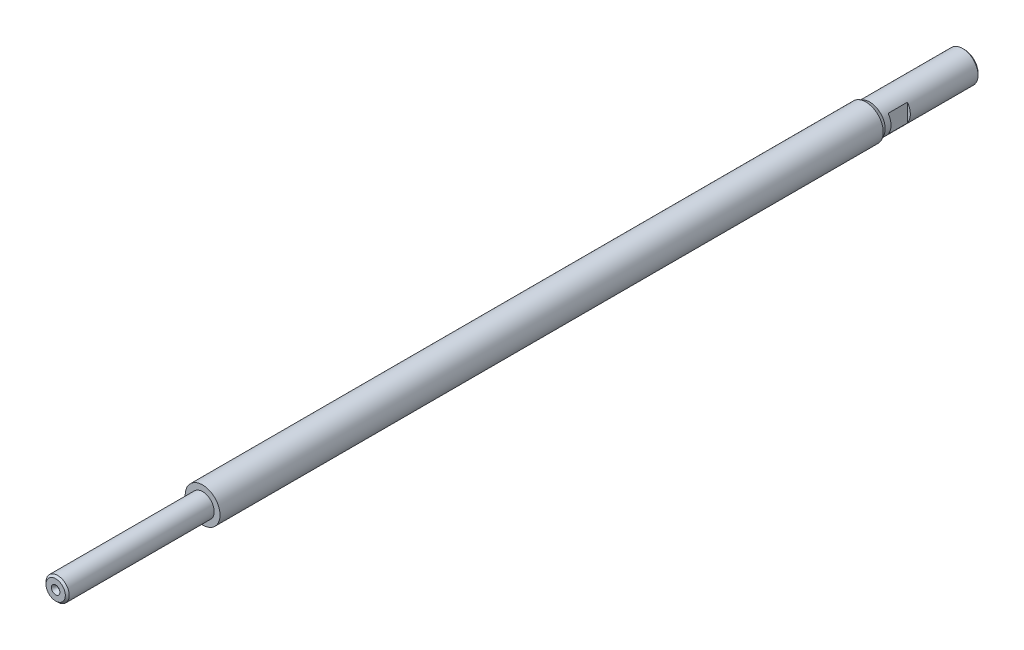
ISO-10303-21;
HEADER;
FILE_DESCRIPTION(('STEP AP214'),'2;1');
FILE_NAME('part.step','',(''),(''),'','','');
FILE_SCHEMA(('AUTOMOTIVE_DESIGN { 1 0 10303 214 1 1 1 1 }'));
ENDSEC;
DATA;
#1=APPLICATION_CONTEXT('core data for automotive mechanical design processes');
#2=APPLICATION_PROTOCOL_DEFINITION('international standard','automotive_design',2000,#1);
#3=PRODUCT_CONTEXT('',#1,'mechanical');
#4=PRODUCT('Part','Part','',(#3));
#5=PRODUCT_RELATED_PRODUCT_CATEGORY('part','',(#4));
#6=PRODUCT_DEFINITION_FORMATION('','',#4);
#7=PRODUCT_DEFINITION_CONTEXT('part definition',#1,'design');
#8=PRODUCT_DEFINITION('design','',#6,#7);
#9=PRODUCT_DEFINITION_SHAPE('','',#8);
#10=(LENGTH_UNIT() NAMED_UNIT(*) SI_UNIT(.MILLI.,.METRE.));
#11=(NAMED_UNIT(*) PLANE_ANGLE_UNIT() SI_UNIT($,.RADIAN.));
#12=(NAMED_UNIT(*) SI_UNIT($,.STERADIAN.) SOLID_ANGLE_UNIT());
#13=UNCERTAINTY_MEASURE_WITH_UNIT(LENGTH_MEASURE(1.E-05),#10,'distance_accuracy_value','');
#14=(GEOMETRIC_REPRESENTATION_CONTEXT(3) GLOBAL_UNCERTAINTY_ASSIGNED_CONTEXT((#13)) GLOBAL_UNIT_ASSIGNED_CONTEXT((#10,
#11,#12)) REPRESENTATION_CONTEXT('',''));
#15=CARTESIAN_POINT('',(0.,0.,0.));
#16=DIRECTION('',(0.,0.,1.));
#17=DIRECTION('',(1.,0.,0.));
#18=AXIS2_PLACEMENT_3D('',#15,#16,#17);
#19=CARTESIAN_POINT('',(0.,0.,-470.));
#20=DIRECTION('',(0.,0.,-1.));
#21=DIRECTION('',(-1.,0.,0.));
#22=AXIS2_PLACEMENT_3D('',#19,#20,#21);
#23=PLANE('',#22);
#24=CARTESIAN_POINT('',(0.,0.,-470.));
#25=DIRECTION('',(0.,0.,-1.));
#26=DIRECTION('',(-1.,0.,0.));
#27=AXIS2_PLACEMENT_3D('',#24,#25,#26);
#28=CIRCLE('',#27,7.);
#29=CARTESIAN_POINT('',(-7.,0.,-470.));
#30=VERTEX_POINT('',#29);
#31=EDGE_CURVE('E356',#30,#30,#28,.T.);
#32=ORIENTED_EDGE('',*,*,#31,.T.);
#33=EDGE_LOOP('',(#32));
#34=FACE_BOUND('',#33,.T.);
#35=CARTESIAN_POINT('',(0.,0.,-470.));
#36=DIRECTION('',(0.,0.,1.));
#37=DIRECTION('',(1.,0.,0.));
#38=AXIS2_PLACEMENT_3D('',#35,#36,#37);
#39=CIRCLE('',#38,2.2124355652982);
#40=CARTESIAN_POINT('',(2.2124355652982,0.,-470.));
#41=VERTEX_POINT('',#40);
#42=EDGE_CURVE('E524',#41,#41,#39,.T.);
#43=ORIENTED_EDGE('',*,*,#42,.T.);
#44=EDGE_LOOP('',(#43));
#45=FACE_BOUND('',#44,.T.);
#46=ADVANCED_FACE('F348',(#34,#45),#23,.T.);
#47=CARTESIAN_POINT('',(0.,0.,0.));
#48=DIRECTION('',(0.,0.,1.));
#49=DIRECTION('',(1.,0.,0.));
#50=AXIS2_PLACEMENT_3D('',#47,#48,#49);
#51=PLANE('',#50);
#52=CARTESIAN_POINT('',(0.,0.,0.));
#53=DIRECTION('',(0.,0.,1.));
#54=DIRECTION('',(1.,0.,0.));
#55=AXIS2_PLACEMENT_3D('',#52,#53,#54);
#56=CIRCLE('',#55,5.);
#57=CARTESIAN_POINT('',(5.,0.,0.));
#58=VERTEX_POINT('',#57);
#59=EDGE_CURVE('E483',#58,#58,#56,.T.);
#60=ORIENTED_EDGE('',*,*,#59,.T.);
#61=EDGE_LOOP('',(#60));
#62=FACE_BOUND('',#61,.T.);
#63=CARTESIAN_POINT('',(0.,0.,0.));
#64=DIRECTION('',(0.,0.,1.));
#65=DIRECTION('',(1.,0.,0.));
#66=AXIS2_PLACEMENT_3D('',#63,#64,#65);
#67=CIRCLE('',#66,2.2124355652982);
#68=CARTESIAN_POINT('',(2.2124355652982,0.,0.));
#69=VERTEX_POINT('',#68);
#70=EDGE_CURVE('E513',#69,#69,#67,.T.);
#71=ORIENTED_EDGE('',*,*,#70,.F.);
#72=EDGE_LOOP('',(#71));
#73=FACE_BOUND('',#72,.T.);
#74=ADVANCED_FACE('F414',(#62,#73),#51,.T.);
#75=CARTESIAN_POINT('',(0.,0.,-470.));
#76=DIRECTION('',(0.,0.,1.));
#77=DIRECTION('',(1.,0.,0.));
#78=AXIS2_PLACEMENT_3D('',#75,#76,#77);
#79=CYLINDRICAL_SURFACE('',#78,8.);
#80=CARTESIAN_POINT('',(0.,0.,-469.));
#81=DIRECTION('',(0.,0.,-1.));
#82=DIRECTION('',(-1.,0.,0.));
#83=AXIS2_PLACEMENT_3D('',#80,#81,#82);
#84=CIRCLE('',#83,8.);
#85=CARTESIAN_POINT('',(-8.,0.,-469.));
#86=VERTEX_POINT('',#85);
#87=EDGE_CURVE('E11',#86,#86,#84,.F.);
#88=ORIENTED_EDGE('',*,*,#87,.T.);
#89=EDGE_LOOP('',(#88));
#90=FACE_BOUND('',#89,.T.);
#91=CARTESIAN_POINT('',(0.,0.,-424.));
#92=DIRECTION('',(0.,0.,1.));
#93=DIRECTION('',(1.,0.,0.));
#94=AXIS2_PLACEMENT_3D('',#91,#92,#93);
#95=CIRCLE('',#94,8.);
#96=CARTESIAN_POINT('',(6.5,-4.66368952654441,-424.));
#97=VERTEX_POINT('',#96);
#98=CARTESIAN_POINT('',(6.5,4.66368952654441,-424.));
#99=VERTEX_POINT('',#98);
#100=EDGE_CURVE('E469',#97,#99,#95,.T.);
#101=ORIENTED_EDGE('',*,*,#100,.T.);
#102=DIRECTION('',(0.,0.,1.));
#103=VECTOR('',#102,1.);
#104=CARTESIAN_POINT('',(6.5,4.66368952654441,-470.));
#105=LINE('',#104,#103);
#106=CARTESIAN_POINT('',(6.5,4.66368952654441,-434.));
#107=VERTEX_POINT('',#106);
#108=EDGE_CURVE('E473',#107,#99,#105,.T.);
#109=ORIENTED_EDGE('',*,*,#108,.F.);
#110=CARTESIAN_POINT('',(0.,0.,-434.));
#111=DIRECTION('',(0.,0.,-1.));
#112=DIRECTION('',(-1.,0.,0.));
#113=AXIS2_PLACEMENT_3D('',#110,#111,#112);
#114=CIRCLE('',#113,8.);
#115=CARTESIAN_POINT('',(6.5,-4.66368952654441,-434.));
#116=VERTEX_POINT('',#115);
#117=EDGE_CURVE('E466',#107,#116,#114,.T.);
#118=ORIENTED_EDGE('',*,*,#117,.T.);
#119=DIRECTION('',(0.,0.,1.));
#120=VECTOR('',#119,1.);
#121=CARTESIAN_POINT('',(6.5,-4.66368952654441,-470.));
#122=LINE('',#121,#120);
#123=EDGE_CURVE('E471',#97,#116,#122,.F.);
#124=ORIENTED_EDGE('',*,*,#123,.F.);
#125=EDGE_LOOP('',(#101,#109,#118,#124));
#126=FACE_BOUND('',#125,.T.);
#127=CARTESIAN_POINT('',(0.,0.,-421.));
#128=DIRECTION('',(0.,0.,-1.));
#129=DIRECTION('',(-1.,0.,0.));
#130=AXIS2_PLACEMENT_3D('',#127,#128,#129);
#131=CIRCLE('',#130,8.);
#132=CARTESIAN_POINT('',(-8.,0.,-421.));
#133=VERTEX_POINT('',#132);
#134=EDGE_CURVE('E457',#133,#133,#131,.T.);
#135=ORIENTED_EDGE('',*,*,#134,.T.);
#136=EDGE_LOOP('',(#135));
#137=FACE_BOUND('',#136,.T.);
#138=DIRECTION('',(0.,0.,1.));
#139=VECTOR('',#138,1.);
#140=CARTESIAN_POINT('',(-6.5,4.66368952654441,-470.));
#141=LINE('',#140,#139);
#142=CARTESIAN_POINT('',(-6.5,4.66368952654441,-424.));
#143=VERTEX_POINT('',#142);
#144=CARTESIAN_POINT('',(-6.5,4.66368952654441,-434.));
#145=VERTEX_POINT('',#144);
#146=EDGE_CURVE('E480',#143,#145,#141,.F.);
#147=ORIENTED_EDGE('',*,*,#146,.F.);
#148=CARTESIAN_POINT('',(0.,0.,-424.));
#149=DIRECTION('',(0.,0.,-1.));
#150=DIRECTION('',(-1.,0.,0.));
#151=AXIS2_PLACEMENT_3D('',#148,#149,#150);
#152=CIRCLE('',#151,8.);
#153=CARTESIAN_POINT('',(-6.5,-4.66368952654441,-424.));
#154=VERTEX_POINT('',#153);
#155=EDGE_CURVE('E362',#154,#143,#152,.T.);
#156=ORIENTED_EDGE('',*,*,#155,.F.);
#157=DIRECTION('',(0.,0.,1.));
#158=VECTOR('',#157,1.);
#159=CARTESIAN_POINT('',(-6.5,-4.66368952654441,-470.));
#160=LINE('',#159,#158);
#161=CARTESIAN_POINT('',(-6.5,-4.66368952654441,-434.));
#162=VERTEX_POINT('',#161);
#163=EDGE_CURVE('E478',#162,#154,#160,.T.);
#164=ORIENTED_EDGE('',*,*,#163,.F.);
#165=CARTESIAN_POINT('',(0.,0.,-434.));
#166=DIRECTION('',(0.,0.,1.));
#167=DIRECTION('',(1.,0.,0.));
#168=AXIS2_PLACEMENT_3D('',#165,#166,#167);
#169=CIRCLE('',#168,8.);
#170=EDGE_CURVE('E475',#145,#162,#169,.T.);
#171=ORIENTED_EDGE('',*,*,#170,.F.);
#172=EDGE_LOOP('',(#147,#156,#164,#171));
#173=FACE_BOUND('',#172,.T.);
#174=ADVANCED_FACE('F420',(#90,#126,#137,#173),#79,.T.);
#175=CARTESIAN_POINT('',(0.,0.,-76.));
#176=DIRECTION('',(0.,0.,1.));
#177=DIRECTION('',(1.,0.,0.));
#178=AXIS2_PLACEMENT_3D('',#175,#176,#177);
#179=CYLINDRICAL_SURFACE('',#178,6.);
#180=CARTESIAN_POINT('',(0.,0.,-1.));
#181=DIRECTION('',(0.,0.,1.));
#182=DIRECTION('',(1.,0.,0.));
#183=AXIS2_PLACEMENT_3D('',#180,#181,#182);
#184=CIRCLE('',#183,6.);
#185=CARTESIAN_POINT('',(6.,0.,-1.));
#186=VERTEX_POINT('',#185);
#187=EDGE_CURVE('E486',#186,#186,#184,.F.);
#188=ORIENTED_EDGE('',*,*,#187,.T.);
#189=EDGE_LOOP('',(#188));
#190=FACE_BOUND('',#189,.T.);
#191=CARTESIAN_POINT('',(0.,0.,-76.));
#192=DIRECTION('',(0.,0.,-1.));
#193=DIRECTION('',(-1.,0.,0.));
#194=AXIS2_PLACEMENT_3D('',#191,#192,#193);
#195=CIRCLE('',#194,6.);
#196=CARTESIAN_POINT('',(-6.,0.,-76.));
#197=VERTEX_POINT('',#196);
#198=EDGE_CURVE('E453',#197,#197,#195,.F.);
#199=ORIENTED_EDGE('',*,*,#198,.T.);
#200=EDGE_LOOP('',(#199));
#201=FACE_BOUND('',#200,.T.);
#202=ADVANCED_FACE('F350',(#190,#201),#179,.T.);
#203=CARTESIAN_POINT('',(0.,0.,-421.));
#204=DIRECTION('',(0.,0.,1.));
#205=DIRECTION('',(1.,0.,0.));
#206=AXIS2_PLACEMENT_3D('',#203,#204,#205);
#207=CYLINDRICAL_SURFACE('',#206,9.);
#208=CARTESIAN_POINT('',(0.,0.,-419.));
#209=DIRECTION('',(0.,0.,-1.));
#210=DIRECTION('',(-1.,0.,0.));
#211=AXIS2_PLACEMENT_3D('',#208,#209,#210);
#212=CIRCLE('',#211,9.);
#213=CARTESIAN_POINT('',(-9.,0.,-419.));
#214=VERTEX_POINT('',#213);
#215=EDGE_CURVE('E448',#214,#214,#212,.F.);
#216=ORIENTED_EDGE('',*,*,#215,.T.);
#217=EDGE_LOOP('',(#216));
#218=FACE_BOUND('',#217,.T.);
#219=CARTESIAN_POINT('',(0.,0.,-76.));
#220=DIRECTION('',(0.,0.,-1.));
#221=DIRECTION('',(-1.,0.,0.));
#222=AXIS2_PLACEMENT_3D('',#219,#220,#221);
#223=CIRCLE('',#222,9.);
#224=CARTESIAN_POINT('',(-9.,0.,-76.));
#225=VERTEX_POINT('',#224);
#226=EDGE_CURVE('E451',#225,#225,#223,.T.);
#227=ORIENTED_EDGE('',*,*,#226,.T.);
#228=EDGE_LOOP('',(#227));
#229=FACE_BOUND('',#228,.T.);
#230=ADVANCED_FACE('F437',(#218,#229),#207,.T.);
#231=CARTESIAN_POINT('',(0.,0.,-76.));
#232=DIRECTION('',(0.,0.,-1.));
#233=DIRECTION('',(-1.,0.,0.));
#234=AXIS2_PLACEMENT_3D('',#231,#232,#233);
#235=PLANE('',#234);
#236=ORIENTED_EDGE('',*,*,#198,.F.);
#237=EDGE_LOOP('',(#236));
#238=FACE_BOUND('',#237,.T.);
#239=ORIENTED_EDGE('',*,*,#226,.F.);
#240=EDGE_LOOP('',(#239));
#241=FACE_BOUND('',#240,.T.);
#242=ADVANCED_FACE('F433',(#238,#241),#235,.F.);
#243=CARTESIAN_POINT('',(0.,0.,-421.));
#244=DIRECTION('',(0.,0.,1.));
#245=DIRECTION('',(1.,0.,0.));
#246=AXIS2_PLACEMENT_3D('',#243,#244,#245);
#247=CONICAL_SURFACE('',#246,8.,0.463647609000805);
#248=ORIENTED_EDGE('',*,*,#215,.F.);
#249=EDGE_LOOP('',(#248));
#250=FACE_BOUND('',#249,.T.);
#251=ORIENTED_EDGE('',*,*,#134,.F.);
#252=EDGE_LOOP('',(#251));
#253=FACE_BOUND('',#252,.T.);
#254=ADVANCED_FACE('F430',(#250,#253),#247,.T.);
#255=CARTESIAN_POINT('',(6.5,14.,-424.));
#256=DIRECTION('',(0.,0.,1.));
#257=DIRECTION('',(1.,0.,0.));
#258=AXIS2_PLACEMENT_3D('',#255,#256,#257);
#259=PLANE('',#258);
#260=ORIENTED_EDGE('',*,*,#100,.F.);
#261=DIRECTION('',(0.,-1.,0.));
#262=VECTOR('',#261,1.);
#263=CARTESIAN_POINT('',(6.5,14.,-424.));
#264=LINE('',#263,#262);
#265=EDGE_CURVE('E370',#99,#97,#264,.T.);
#266=ORIENTED_EDGE('',*,*,#265,.F.);
#267=EDGE_LOOP('',(#260,#266));
#268=FACE_BOUND('',#267,.T.);
#269=ADVANCED_FACE('F426',(#268),#259,.F.);
#270=CARTESIAN_POINT('',(6.5,14.,-434.));
#271=DIRECTION('',(0.,0.,-1.));
#272=DIRECTION('',(-1.,0.,0.));
#273=AXIS2_PLACEMENT_3D('',#270,#271,#272);
#274=PLANE('',#273);
#275=DIRECTION('',(0.,1.,0.));
#276=VECTOR('',#275,1.);
#277=CARTESIAN_POINT('',(6.5,14.,-434.));
#278=LINE('',#277,#276);
#279=EDGE_CURVE('E454',#116,#107,#278,.T.);
#280=ORIENTED_EDGE('',*,*,#279,.F.);
#281=ORIENTED_EDGE('',*,*,#117,.F.);
#282=EDGE_LOOP('',(#280,#281));
#283=FACE_BOUND('',#282,.T.);
#284=ADVANCED_FACE('F563',(#283),#274,.F.);
#285=CARTESIAN_POINT('',(6.5,-12.,-424.));
#286=DIRECTION('',(1.,0.,0.));
#287=DIRECTION('',(0.,0.,-1.));
#288=AXIS2_PLACEMENT_3D('',#285,#286,#287);
#289=PLANE('',#288);
#290=ORIENTED_EDGE('',*,*,#108,.T.);
#291=ORIENTED_EDGE('',*,*,#265,.T.);
#292=ORIENTED_EDGE('',*,*,#123,.T.);
#293=ORIENTED_EDGE('',*,*,#279,.T.);
#294=EDGE_LOOP('',(#290,#291,#292,#293));
#295=FACE_BOUND('',#294,.T.);
#296=ADVANCED_FACE('F561',(#295),#289,.T.);
#297=CARTESIAN_POINT('',(-6.5,14.,-424.));
#298=DIRECTION('',(0.,0.,-1.));
#299=DIRECTION('',(-1.,0.,0.));
#300=AXIS2_PLACEMENT_3D('',#297,#298,#299);
#301=PLANE('',#300);
#302=ORIENTED_EDGE('',*,*,#155,.T.);
#303=DIRECTION('',(0.,-1.,0.));
#304=VECTOR('',#303,1.);
#305=CARTESIAN_POINT('',(-6.5,14.,-424.));
#306=LINE('',#305,#304);
#307=EDGE_CURVE('E509',#143,#154,#306,.T.);
#308=ORIENTED_EDGE('',*,*,#307,.T.);
#309=EDGE_LOOP('',(#302,#308));
#310=FACE_BOUND('',#309,.T.);
#311=ADVANCED_FACE('F558',(#310),#301,.T.);
#312=CARTESIAN_POINT('',(-6.5,14.,-434.));
#313=DIRECTION('',(0.,0.,1.));
#314=DIRECTION('',(1.,0.,0.));
#315=AXIS2_PLACEMENT_3D('',#312,#313,#314);
#316=PLANE('',#315);
#317=DIRECTION('',(0.,1.,0.));
#318=VECTOR('',#317,1.);
#319=CARTESIAN_POINT('',(-6.5,14.,-434.));
#320=LINE('',#319,#318);
#321=EDGE_CURVE('E508',#162,#145,#320,.T.);
#322=ORIENTED_EDGE('',*,*,#321,.T.);
#323=ORIENTED_EDGE('',*,*,#170,.T.);
#324=EDGE_LOOP('',(#322,#323));
#325=FACE_BOUND('',#324,.T.);
#326=ADVANCED_FACE('F511',(#325),#316,.T.);
#327=CARTESIAN_POINT('',(-6.5,-12.,-424.));
#328=DIRECTION('',(-1.,0.,0.));
#329=DIRECTION('',(0.,0.,-1.));
#330=AXIS2_PLACEMENT_3D('',#327,#328,#329);
#331=PLANE('',#330);
#332=ORIENTED_EDGE('',*,*,#163,.T.);
#333=ORIENTED_EDGE('',*,*,#307,.F.);
#334=ORIENTED_EDGE('',*,*,#146,.T.);
#335=ORIENTED_EDGE('',*,*,#321,.F.);
#336=EDGE_LOOP('',(#332,#333,#334,#335));
#337=FACE_BOUND('',#336,.T.);
#338=ADVANCED_FACE('F507',(#337),#331,.T.);
#339=CARTESIAN_POINT('',(0.,0.,-2.1));
#340=DIRECTION('',(0.,0.,1.));
#341=DIRECTION('',(1.,0.,0.));
#342=AXIS2_PLACEMENT_3D('',#339,#340,#341);
#343=CONICAL_SURFACE('',#342,1.,0.523598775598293);
#344=ORIENTED_EDGE('',*,*,#70,.T.);
#345=EDGE_LOOP('',(#344));
#346=FACE_BOUND('',#345,.T.);
#347=CARTESIAN_POINT('',(0.,0.,-2.1));
#348=DIRECTION('',(0.,0.,1.));
#349=DIRECTION('',(1.,0.,0.));
#350=AXIS2_PLACEMENT_3D('',#347,#348,#349);
#351=CIRCLE('',#350,1.);
#352=CARTESIAN_POINT('',(1.,0.,-2.1));
#353=VERTEX_POINT('',#352);
#354=EDGE_CURVE('E518',#353,#353,#351,.T.);
#355=ORIENTED_EDGE('',*,*,#354,.F.);
#356=EDGE_LOOP('',(#355));
#357=FACE_BOUND('',#356,.T.);
#358=ADVANCED_FACE('F549',(#346,#357),#343,.F.);
#359=CARTESIAN_POINT('',(0.,0.,1.));
#360=DIRECTION('',(0.,0.,1.));
#361=DIRECTION('',(1.,0.,0.));
#362=AXIS2_PLACEMENT_3D('',#359,#360,#361);
#363=CYLINDRICAL_SURFACE('',#362,1.);
#364=ORIENTED_EDGE('',*,*,#354,.T.);
#365=EDGE_LOOP('',(#364));
#366=FACE_BOUND('',#365,.T.);
#367=CARTESIAN_POINT('',(0.,0.,-4.42264973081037));
#368=DIRECTION('',(0.,0.,1.));
#369=DIRECTION('',(1.,0.,0.));
#370=AXIS2_PLACEMENT_3D('',#367,#368,#369);
#371=CIRCLE('',#370,1.);
#372=CARTESIAN_POINT('',(1.,0.,-4.42264973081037));
#373=VERTEX_POINT('',#372);
#374=EDGE_CURVE('E521',#373,#373,#371,.T.);
#375=ORIENTED_EDGE('',*,*,#374,.F.);
#376=EDGE_LOOP('',(#375));
#377=FACE_BOUND('',#376,.T.);
#378=ADVANCED_FACE('F542',(#366,#377),#363,.F.);
#379=CARTESIAN_POINT('',(0.,0.,-5.));
#380=DIRECTION('',(0.,0.,1.));
#381=DIRECTION('',(1.,0.,0.));
#382=AXIS2_PLACEMENT_3D('',#379,#380,#381);
#383=CONICAL_SURFACE('',#382,0.,1.04719755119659);
#384=ORIENTED_EDGE('',*,*,#374,.T.);
#385=EDGE_LOOP('',(#384));
#386=FACE_BOUND('',#385,.T.);
#387=CARTESIAN_POINT('',(0.,0.,-5.));
#388=VERTEX_POINT('',#387);
#389=VERTEX_LOOP('',#388);
#390=FACE_BOUND('',#389,.T.);
#391=ADVANCED_FACE('F536',(#386,#390),#383,.F.);
#392=CARTESIAN_POINT('',(0.,0.,-467.9));
#393=DIRECTION('',(0.,0.,-1.));
#394=DIRECTION('',(1.,0.,0.));
#395=AXIS2_PLACEMENT_3D('',#392,#393,#394);
#396=CONICAL_SURFACE('',#395,1.,0.523598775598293);
#397=ORIENTED_EDGE('',*,*,#42,.F.);
#398=EDGE_LOOP('',(#397));
#399=FACE_BOUND('',#398,.T.);
#400=CARTESIAN_POINT('',(0.,0.,-467.9));
#401=DIRECTION('',(0.,0.,1.));
#402=DIRECTION('',(1.,0.,0.));
#403=AXIS2_PLACEMENT_3D('',#400,#401,#402);
#404=CIRCLE('',#403,1.);
#405=CARTESIAN_POINT('',(1.,0.,-467.9));
#406=VERTEX_POINT('',#405);
#407=EDGE_CURVE('E527',#406,#406,#404,.T.);
#408=ORIENTED_EDGE('',*,*,#407,.T.);
#409=EDGE_LOOP('',(#408));
#410=FACE_BOUND('',#409,.T.);
#411=ADVANCED_FACE('F409',(#399,#410),#396,.F.);
#412=CARTESIAN_POINT('',(0.,0.,-471.));
#413=DIRECTION('',(0.,0.,-1.));
#414=DIRECTION('',(1.,0.,0.));
#415=AXIS2_PLACEMENT_3D('',#412,#413,#414);
#416=CYLINDRICAL_SURFACE('',#415,1.);
#417=ORIENTED_EDGE('',*,*,#407,.F.);
#418=EDGE_LOOP('',(#417));
#419=FACE_BOUND('',#418,.T.);
#420=CARTESIAN_POINT('',(0.,0.,-465.57735026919));
#421=DIRECTION('',(0.,0.,1.));
#422=DIRECTION('',(1.,0.,0.));
#423=AXIS2_PLACEMENT_3D('',#420,#421,#422);
#424=CIRCLE('',#423,1.);
#425=CARTESIAN_POINT('',(1.,0.,-465.57735026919));
#426=VERTEX_POINT('',#425);
#427=EDGE_CURVE('E530',#426,#426,#424,.T.);
#428=ORIENTED_EDGE('',*,*,#427,.T.);
#429=EDGE_LOOP('',(#428));
#430=FACE_BOUND('',#429,.T.);
#431=ADVANCED_FACE('F398',(#419,#430),#416,.F.);
#432=CARTESIAN_POINT('',(0.,0.,-465.));
#433=DIRECTION('',(0.,0.,-1.));
#434=DIRECTION('',(1.,0.,0.));
#435=AXIS2_PLACEMENT_3D('',#432,#433,#434);
#436=CONICAL_SURFACE('',#435,0.,1.04719755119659);
#437=ORIENTED_EDGE('',*,*,#427,.F.);
#438=EDGE_LOOP('',(#437));
#439=FACE_BOUND('',#438,.T.);
#440=CARTESIAN_POINT('',(0.,0.,-465.));
#441=VERTEX_POINT('',#440);
#442=VERTEX_LOOP('',#441);
#443=FACE_BOUND('',#442,.T.);
#444=ADVANCED_FACE('F395',(#439,#443),#436,.F.);
#445=CARTESIAN_POINT('',(0.,0.,0.));
#446=DIRECTION('',(0.,0.,-1.));
#447=DIRECTION('',(-1.,0.,0.));
#448=AXIS2_PLACEMENT_3D('',#445,#446,#447);
#449=CONICAL_SURFACE('',#448,5.,0.785398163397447);
#450=ORIENTED_EDGE('',*,*,#187,.F.);
#451=EDGE_LOOP('',(#450));
#452=FACE_BOUND('',#451,.T.);
#453=ORIENTED_EDGE('',*,*,#59,.F.);
#454=EDGE_LOOP('',(#453));
#455=FACE_BOUND('',#454,.T.);
#456=ADVANCED_FACE('F397',(#452,#455),#449,.T.);
#457=CARTESIAN_POINT('',(0.,0.,-470.));
#458=DIRECTION('',(0.,0.,1.));
#459=DIRECTION('',(1.,0.,0.));
#460=AXIS2_PLACEMENT_3D('',#457,#458,#459);
#461=CONICAL_SURFACE('',#460,7.,0.785398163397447);
#462=ORIENTED_EDGE('',*,*,#87,.F.);
#463=EDGE_LOOP('',(#462));
#464=FACE_BOUND('',#463,.T.);
#465=ORIENTED_EDGE('',*,*,#31,.F.);
#466=EDGE_LOOP('',(#465));
#467=FACE_BOUND('',#466,.T.);
#468=ADVANCED_FACE('F406',(#464,#467),#461,.T.);
#469=CLOSED_SHELL('',(#46,#74,#174,#202,#230,#242,#254,#269,#284,#296,#311,#326,#338,#358,#378,
#391,#411,#431,#444,#456,#468));
#470=MANIFOLD_SOLID_BREP('B2',#469);
#471=ADVANCED_BREP_SHAPE_REPRESENTATION('',(#18,#470),#14);
#472=SHAPE_DEFINITION_REPRESENTATION(#9,#471);
ENDSEC;
END-ISO-10303-21;
